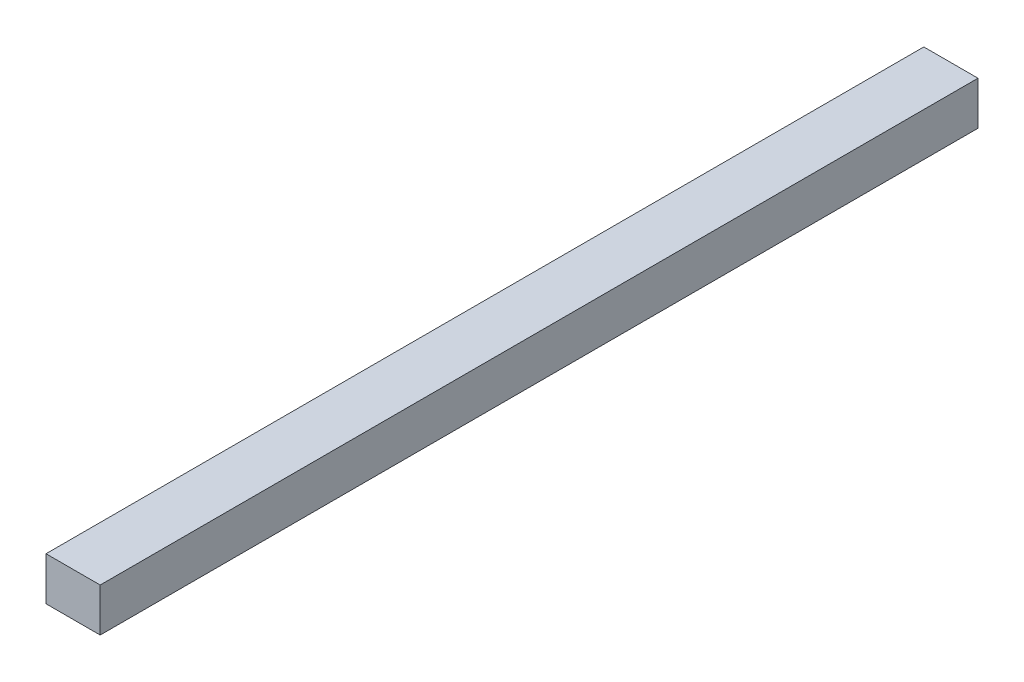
ISO-10303-21;
HEADER;
FILE_DESCRIPTION(('STEP AP214'),'2;1');
FILE_NAME('part.step','',(''),(''),'','','');
FILE_SCHEMA(('AUTOMOTIVE_DESIGN { 1 0 10303 214 1 1 1 1 }'));
ENDSEC;
DATA;
#1=APPLICATION_CONTEXT('core data for automotive mechanical design processes');
#2=APPLICATION_PROTOCOL_DEFINITION('international standard','automotive_design',2000,#1);
#3=PRODUCT_CONTEXT('',#1,'mechanical');
#4=PRODUCT('Part','Part','',(#3));
#5=PRODUCT_RELATED_PRODUCT_CATEGORY('part','',(#4));
#6=PRODUCT_DEFINITION_FORMATION('','',#4);
#7=PRODUCT_DEFINITION_CONTEXT('part definition',#1,'design');
#8=PRODUCT_DEFINITION('design','',#6,#7);
#9=PRODUCT_DEFINITION_SHAPE('','',#8);
#10=(LENGTH_UNIT() NAMED_UNIT(*) SI_UNIT(.MILLI.,.METRE.));
#11=(NAMED_UNIT(*) PLANE_ANGLE_UNIT() SI_UNIT($,.RADIAN.));
#12=(NAMED_UNIT(*) SI_UNIT($,.STERADIAN.) SOLID_ANGLE_UNIT());
#13=UNCERTAINTY_MEASURE_WITH_UNIT(LENGTH_MEASURE(1.E-05),#10,'distance_accuracy_value','');
#14=(GEOMETRIC_REPRESENTATION_CONTEXT(3) GLOBAL_UNCERTAINTY_ASSIGNED_CONTEXT((#13)) GLOBAL_UNIT_ASSIGNED_CONTEXT((#10,
#11,#12)) REPRESENTATION_CONTEXT('',''));
#15=CARTESIAN_POINT('',(0.,0.,0.));
#16=DIRECTION('',(0.,0.,1.));
#17=DIRECTION('',(1.,0.,0.));
#18=AXIS2_PLACEMENT_3D('',#15,#16,#17);
#19=CARTESIAN_POINT('',(0.,0.,81.));
#20=DIRECTION('',(1.,0.,0.));
#21=DIRECTION('',(0.,0.,-1.));
#22=AXIS2_PLACEMENT_3D('',#19,#20,#21);
#23=PLANE('',#22);
#24=DIRECTION('',(0.,-1.,0.));
#25=VECTOR('',#24,1.);
#26=CARTESIAN_POINT('',(0.,0.,0.));
#27=LINE('',#26,#25);
#28=CARTESIAN_POINT('',(0.,4.,0.));
#29=VERTEX_POINT('',#28);
#30=CARTESIAN_POINT('',(0.,0.,0.));
#31=VERTEX_POINT('',#30);
#32=EDGE_CURVE('E94',#29,#31,#27,.T.);
#33=ORIENTED_EDGE('',*,*,#32,.T.);
#34=DIRECTION('',(0.,0.,-1.));
#35=VECTOR('',#34,1.);
#36=CARTESIAN_POINT('',(0.,0.,81.));
#37=LINE('',#36,#35);
#38=CARTESIAN_POINT('',(0.,0.,81.));
#39=VERTEX_POINT('',#38);
#40=EDGE_CURVE('E11',#39,#31,#37,.T.);
#41=ORIENTED_EDGE('',*,*,#40,.F.);
#42=DIRECTION('',(0.,-1.,0.));
#43=VECTOR('',#42,1.);
#44=CARTESIAN_POINT('',(0.,0.,81.));
#45=LINE('',#44,#43);
#46=CARTESIAN_POINT('',(0.,4.,81.));
#47=VERTEX_POINT('',#46);
#48=EDGE_CURVE('E82',#47,#39,#45,.T.);
#49=ORIENTED_EDGE('',*,*,#48,.F.);
#50=DIRECTION('',(0.,0.,-1.));
#51=VECTOR('',#50,1.);
#52=CARTESIAN_POINT('',(0.,4.,81.));
#53=LINE('',#52,#51);
#54=EDGE_CURVE('E90',#47,#29,#53,.T.);
#55=ORIENTED_EDGE('',*,*,#54,.T.);
#56=EDGE_LOOP('',(#33,#41,#49,#55));
#57=FACE_BOUND('',#56,.T.);
#58=ADVANCED_FACE('F31',(#57),#23,.F.);
#59=CARTESIAN_POINT('',(0.,0.,81.));
#60=DIRECTION('',(0.,1.,0.));
#61=DIRECTION('',(0.,0.,1.));
#62=AXIS2_PLACEMENT_3D('',#59,#60,#61);
#63=PLANE('',#62);
#64=DIRECTION('',(1.,0.,0.));
#65=VECTOR('',#64,1.);
#66=CARTESIAN_POINT('',(0.,0.,0.));
#67=LINE('',#66,#65);
#68=CARTESIAN_POINT('',(5.,0.,0.));
#69=VERTEX_POINT('',#68);
#70=EDGE_CURVE('E86',#31,#69,#67,.T.);
#71=ORIENTED_EDGE('',*,*,#70,.T.);
#72=DIRECTION('',(0.,0.,-1.));
#73=VECTOR('',#72,1.);
#74=CARTESIAN_POINT('',(5.,0.,81.));
#75=LINE('',#74,#73);
#76=CARTESIAN_POINT('',(5.,0.,81.));
#77=VERTEX_POINT('',#76);
#78=EDGE_CURVE('E39',#77,#69,#75,.T.);
#79=ORIENTED_EDGE('',*,*,#78,.F.);
#80=DIRECTION('',(1.,0.,0.));
#81=VECTOR('',#80,1.);
#82=CARTESIAN_POINT('',(0.,0.,81.));
#83=LINE('',#82,#81);
#84=EDGE_CURVE('E77',#39,#77,#83,.T.);
#85=ORIENTED_EDGE('',*,*,#84,.F.);
#86=ORIENTED_EDGE('',*,*,#40,.T.);
#87=EDGE_LOOP('',(#71,#79,#85,#86));
#88=FACE_BOUND('',#87,.T.);
#89=ADVANCED_FACE('F85',(#88),#63,.F.);
#90=CARTESIAN_POINT('',(5.,0.,81.));
#91=DIRECTION('',(-1.,0.,0.));
#92=DIRECTION('',(0.,-1.,0.));
#93=AXIS2_PLACEMENT_3D('',#90,#91,#92);
#94=PLANE('',#93);
#95=DIRECTION('',(0.,1.,0.));
#96=VECTOR('',#95,1.);
#97=CARTESIAN_POINT('',(5.,0.,0.));
#98=LINE('',#97,#96);
#99=CARTESIAN_POINT('',(5.,4.,0.));
#100=VERTEX_POINT('',#99);
#101=EDGE_CURVE('E64',#69,#100,#98,.T.);
#102=ORIENTED_EDGE('',*,*,#101,.T.);
#103=DIRECTION('',(0.,0.,-1.));
#104=VECTOR('',#103,1.);
#105=CARTESIAN_POINT('',(5.,4.,81.));
#106=LINE('',#105,#104);
#107=CARTESIAN_POINT('',(5.,4.,81.));
#108=VERTEX_POINT('',#107);
#109=EDGE_CURVE('E87',#108,#100,#106,.T.);
#110=ORIENTED_EDGE('',*,*,#109,.F.);
#111=DIRECTION('',(0.,1.,0.));
#112=VECTOR('',#111,1.);
#113=CARTESIAN_POINT('',(5.,0.,81.));
#114=LINE('',#113,#112);
#115=EDGE_CURVE('E80',#77,#108,#114,.T.);
#116=ORIENTED_EDGE('',*,*,#115,.F.);
#117=ORIENTED_EDGE('',*,*,#78,.T.);
#118=EDGE_LOOP('',(#102,#110,#116,#117));
#119=FACE_BOUND('',#118,.T.);
#120=ADVANCED_FACE('F88',(#119),#94,.F.);
#121=CARTESIAN_POINT('',(0.,4.,81.));
#122=DIRECTION('',(0.,-1.,0.));
#123=DIRECTION('',(0.,0.,-1.));
#124=AXIS2_PLACEMENT_3D('',#121,#122,#123);
#125=PLANE('',#124);
#126=DIRECTION('',(-1.,0.,0.));
#127=VECTOR('',#126,1.);
#128=CARTESIAN_POINT('',(0.,4.,0.));
#129=LINE('',#128,#127);
#130=EDGE_CURVE('E70',#100,#29,#129,.T.);
#131=ORIENTED_EDGE('',*,*,#130,.T.);
#132=ORIENTED_EDGE('',*,*,#54,.F.);
#133=DIRECTION('',(-1.,0.,0.));
#134=VECTOR('',#133,1.);
#135=CARTESIAN_POINT('',(0.,4.,81.));
#136=LINE('',#135,#134);
#137=EDGE_CURVE('E47',#108,#47,#136,.T.);
#138=ORIENTED_EDGE('',*,*,#137,.F.);
#139=ORIENTED_EDGE('',*,*,#109,.T.);
#140=EDGE_LOOP('',(#131,#132,#138,#139));
#141=FACE_BOUND('',#140,.T.);
#142=ADVANCED_FACE('F101',(#141),#125,.F.);
#143=CARTESIAN_POINT('',(0.,4.,81.));
#144=DIRECTION('',(0.,0.,-1.));
#145=DIRECTION('',(-1.,0.,0.));
#146=AXIS2_PLACEMENT_3D('',#143,#144,#145);
#147=PLANE('',#146);
#148=ORIENTED_EDGE('',*,*,#48,.T.);
#149=ORIENTED_EDGE('',*,*,#84,.T.);
#150=ORIENTED_EDGE('',*,*,#115,.T.);
#151=ORIENTED_EDGE('',*,*,#137,.T.);
#152=EDGE_LOOP('',(#148,#149,#150,#151));
#153=FACE_BOUND('',#152,.T.);
#154=ADVANCED_FACE('F78',(#153),#147,.F.);
#155=CARTESIAN_POINT('',(0.,4.,0.));
#156=DIRECTION('',(0.,0.,-1.));
#157=DIRECTION('',(-1.,0.,0.));
#158=AXIS2_PLACEMENT_3D('',#155,#156,#157);
#159=PLANE('',#158);
#160=ORIENTED_EDGE('',*,*,#32,.F.);
#161=ORIENTED_EDGE('',*,*,#130,.F.);
#162=ORIENTED_EDGE('',*,*,#101,.F.);
#163=ORIENTED_EDGE('',*,*,#70,.F.);
#164=EDGE_LOOP('',(#160,#161,#162,#163));
#165=FACE_BOUND('',#164,.T.);
#166=ADVANCED_FACE('F104',(#165),#159,.T.);
#167=CLOSED_SHELL('',(#58,#89,#120,#142,#154,#166));
#168=MANIFOLD_SOLID_BREP('B2',#167);
#169=ADVANCED_BREP_SHAPE_REPRESENTATION('',(#18,#168),#14);
#170=SHAPE_DEFINITION_REPRESENTATION(#9,#169);
ENDSEC;
END-ISO-10303-21;
